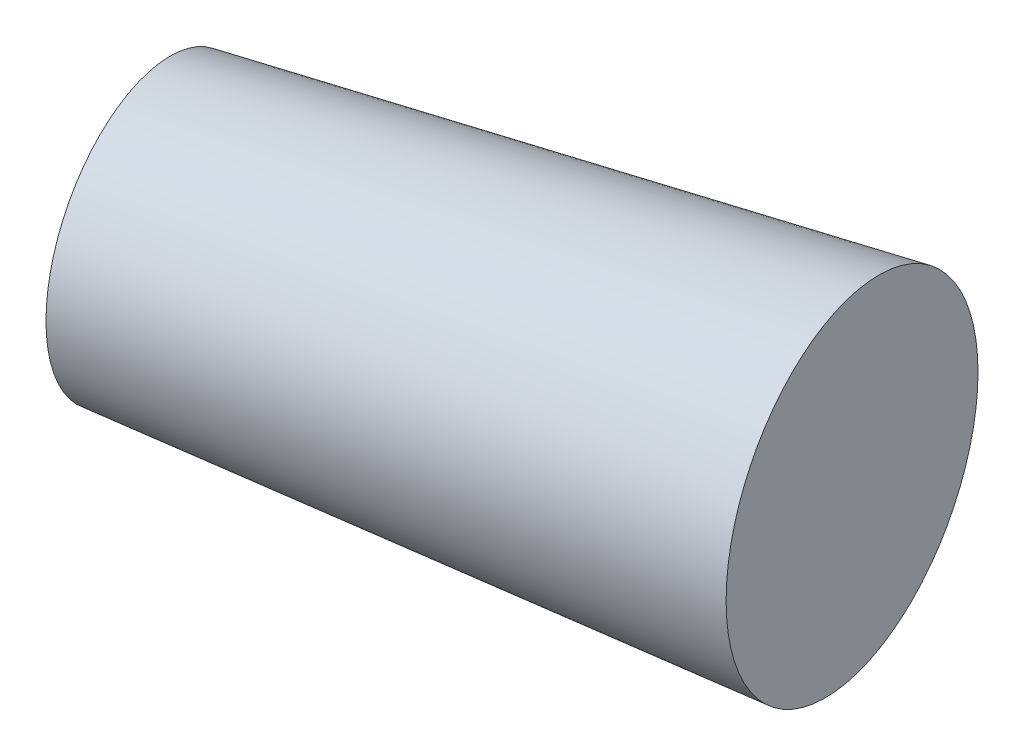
ISO-10303-21;
HEADER;
FILE_DESCRIPTION(('STEP AP214'),'2;1');
FILE_NAME('part.step','',(''),(''),'','','');
FILE_SCHEMA(('AUTOMOTIVE_DESIGN { 1 0 10303 214 1 1 1 1 }'));
ENDSEC;
DATA;
#1=APPLICATION_CONTEXT('core data for automotive mechanical design processes');
#2=APPLICATION_PROTOCOL_DEFINITION('international standard','automotive_design',2000,#1);
#3=PRODUCT_CONTEXT('',#1,'mechanical');
#4=PRODUCT('Part','Part','',(#3));
#5=PRODUCT_RELATED_PRODUCT_CATEGORY('part','',(#4));
#6=PRODUCT_DEFINITION_FORMATION('','',#4);
#7=PRODUCT_DEFINITION_CONTEXT('part definition',#1,'design');
#8=PRODUCT_DEFINITION('design','',#6,#7);
#9=PRODUCT_DEFINITION_SHAPE('','',#8);
#10=(LENGTH_UNIT() NAMED_UNIT(*) SI_UNIT(.MILLI.,.METRE.));
#11=(NAMED_UNIT(*) PLANE_ANGLE_UNIT() SI_UNIT($,.RADIAN.));
#12=(NAMED_UNIT(*) SI_UNIT($,.STERADIAN.) SOLID_ANGLE_UNIT());
#13=UNCERTAINTY_MEASURE_WITH_UNIT(LENGTH_MEASURE(1.E-05),#10,'distance_accuracy_value','');
#14=(GEOMETRIC_REPRESENTATION_CONTEXT(3) GLOBAL_UNCERTAINTY_ASSIGNED_CONTEXT((#13)) GLOBAL_UNIT_ASSIGNED_CONTEXT((#10,
#11,#12)) REPRESENTATION_CONTEXT('',''));
#15=CARTESIAN_POINT('',(0.,0.,0.));
#16=DIRECTION('',(0.,0.,1.));
#17=DIRECTION('',(1.,0.,0.));
#18=AXIS2_PLACEMENT_3D('',#15,#16,#17);
#19=CARTESIAN_POINT('',(3.40344124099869,0.,-0.756320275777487));
#20=DIRECTION('',(0.976187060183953,0.,-0.216930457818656));
#21=DIRECTION('',(-0.216930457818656,0.,-0.976187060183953));
#22=AXIS2_PLACEMENT_3D('',#19,#20,#21);
#23=CONICAL_SURFACE('',#22,2.74999999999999,0.0523598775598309);
#24=CARTESIAN_POINT('',(-6.13984863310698,0.,1.36441080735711));
#25=DIRECTION('',(-0.976187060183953,0.,0.216930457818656));
#26=DIRECTION('',(0.216930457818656,0.,0.976187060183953));
#27=AXIS2_PLACEMENT_3D('',#24,#25,#26);
#28=CIRCLE('',#27,2.23765697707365);
#29=CARTESIAN_POINT('',(-5.65443268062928,0.,3.54878259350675));
#30=VERTEX_POINT('',#29);
#31=EDGE_CURVE('E10',#30,#30,#28,.T.);
#32=ORIENTED_EDGE('',*,*,#31,.F.);
#33=EDGE_LOOP('',(#32));
#34=FACE_BOUND('',#33,.T.);
#35=CARTESIAN_POINT('',(3.40344124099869,0.,-0.756320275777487));
#36=DIRECTION('',(-0.976187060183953,0.,0.216930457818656));
#37=DIRECTION('',(0.216930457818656,0.,0.976187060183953));
#38=AXIS2_PLACEMENT_3D('',#35,#36,#37);
#39=CIRCLE('',#38,2.74999999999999);
#40=CARTESIAN_POINT('',(3.99999999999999,0.,1.92819413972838));
#41=VERTEX_POINT('',#40);
#42=EDGE_CURVE('E30',#41,#41,#39,.T.);
#43=ORIENTED_EDGE('',*,*,#42,.T.);
#44=EDGE_LOOP('',(#43));
#45=FACE_BOUND('',#44,.T.);
#46=ADVANCED_FACE('F24',(#34,#45),#23,.T.);
#47=CARTESIAN_POINT('',(-6.13984863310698,0.,1.36441080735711));
#48=DIRECTION('',(0.976187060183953,0.,-0.216930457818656));
#49=DIRECTION('',(-0.216930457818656,0.,-0.976187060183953));
#50=AXIS2_PLACEMENT_3D('',#47,#48,#49);
#51=PLANE('',#50);
#52=ORIENTED_EDGE('',*,*,#31,.T.);
#53=EDGE_LOOP('',(#52));
#54=FACE_BOUND('',#53,.T.);
#55=ADVANCED_FACE('F39',(#54),#51,.F.);
#56=CARTESIAN_POINT('',(3.40344124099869,0.,-0.756320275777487));
#57=DIRECTION('',(-0.976187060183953,0.,0.216930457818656));
#58=DIRECTION('',(0.216930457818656,0.,0.976187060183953));
#59=AXIS2_PLACEMENT_3D('',#56,#57,#58);
#60=PLANE('',#59);
#61=ORIENTED_EDGE('',*,*,#42,.F.);
#62=EDGE_LOOP('',(#61));
#63=FACE_BOUND('',#62,.T.);
#64=ADVANCED_FACE('F37',(#63),#60,.F.);
#65=CLOSED_SHELL('',(#46,#55,#64));
#66=MANIFOLD_SOLID_BREP('B2',#65);
#67=ADVANCED_BREP_SHAPE_REPRESENTATION('',(#18,#66),#14);
#68=SHAPE_DEFINITION_REPRESENTATION(#9,#67);
ENDSEC;
END-ISO-10303-21;
